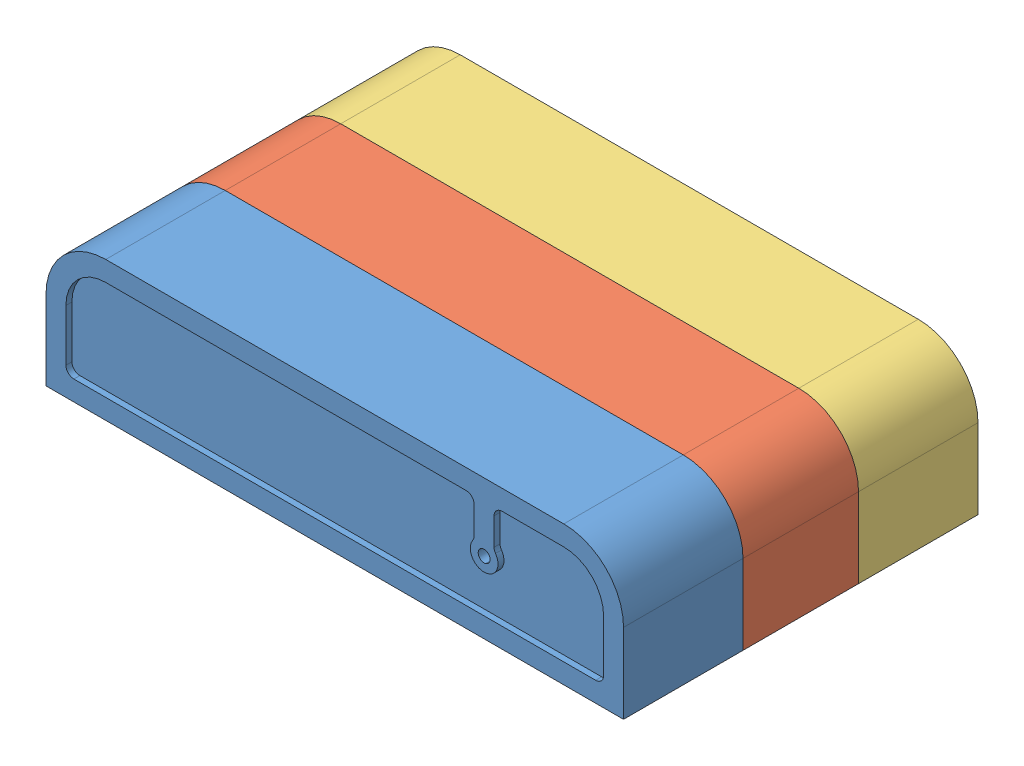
SolidWorks assembly BOX_ALL.SLDASM, configuration По умолчанию (file format 12000). Lengths in mm.
Overall size (145 35 89.84).
3 component instances, 3 part files, 5 mates.
Components (placement in the parent):
- B1-1: B1.SLDPRT [По умолчанию] at origin size (145 35 30)
- B2-1: B2.SLDPRT [По умолчанию] at origin size (145 35 29)
- B3-1: B3.SLDPRT [По умолчанию] at (1.3084 -1.0816 0.773) size (145 35 30.84)
Mates (geometry in assembly coordinates):
- Совпадение1: coincident anti-aligned: circle of B1-1; circle of B2-1
- Совпадение2: coincident anti-aligned: circle of B1-1; circle of B2-1
- Совпадение3: coincident aligned: circle of B2-1; circle of B3-1
- Совпадение4: coincident anti-aligned: plane of B2-1 through (-57.5 20 31) normal (0 0 -1); plane of B3-1 through (-57.5 20 31) normal (0 0 1)
- Совпадение5: coincident aligned: circle of B2-1; circle of B3-1
